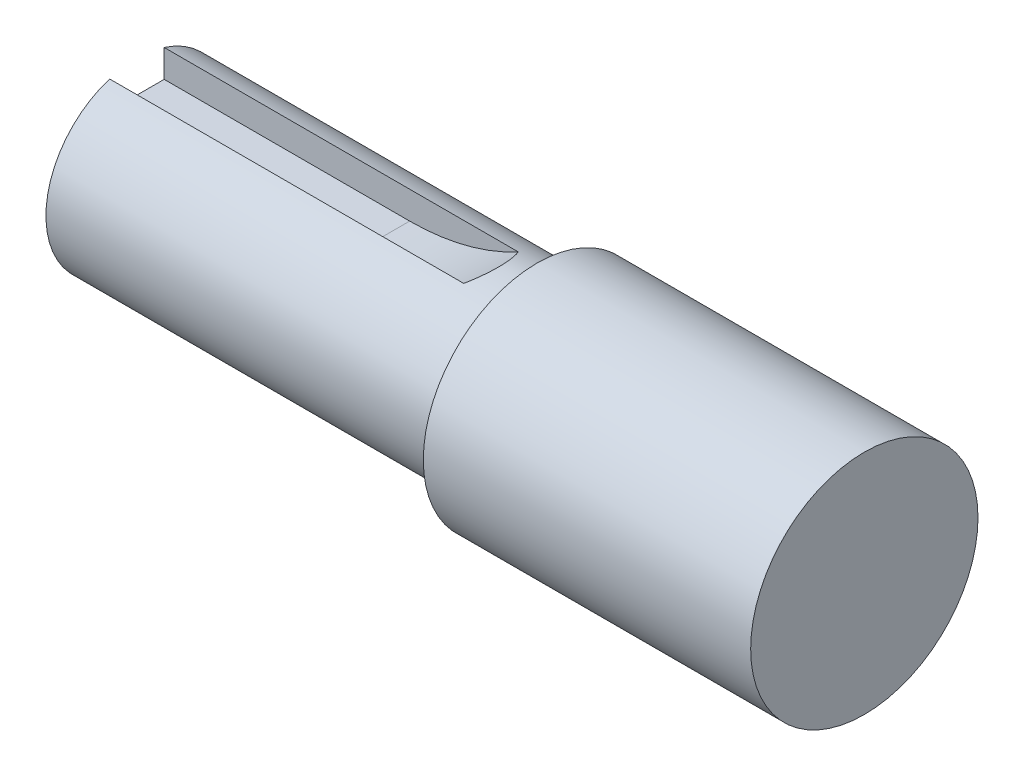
ISO-10303-21;
HEADER;
FILE_DESCRIPTION(('STEP AP214'),'2;1');
FILE_NAME('part.step','',(''),(''),'','','');
FILE_SCHEMA(('AUTOMOTIVE_DESIGN { 1 0 10303 214 1 1 1 1 }'));
ENDSEC;
DATA;
#1=APPLICATION_CONTEXT('core data for automotive mechanical design processes');
#2=APPLICATION_PROTOCOL_DEFINITION('international standard','automotive_design',2000,#1);
#3=PRODUCT_CONTEXT('',#1,'mechanical');
#4=PRODUCT('Part','Part','',(#3));
#5=PRODUCT_RELATED_PRODUCT_CATEGORY('part','',(#4));
#6=PRODUCT_DEFINITION_FORMATION('','',#4);
#7=PRODUCT_DEFINITION_CONTEXT('part definition',#1,'design');
#8=PRODUCT_DEFINITION('design','',#6,#7);
#9=PRODUCT_DEFINITION_SHAPE('','',#8);
#10=(LENGTH_UNIT() NAMED_UNIT(*) SI_UNIT(.MILLI.,.METRE.));
#11=(NAMED_UNIT(*) PLANE_ANGLE_UNIT() SI_UNIT($,.RADIAN.));
#12=(NAMED_UNIT(*) SI_UNIT($,.STERADIAN.) SOLID_ANGLE_UNIT());
#13=UNCERTAINTY_MEASURE_WITH_UNIT(LENGTH_MEASURE(1.E-05),#10,'distance_accuracy_value','');
#14=(GEOMETRIC_REPRESENTATION_CONTEXT(3) GLOBAL_UNCERTAINTY_ASSIGNED_CONTEXT((#13)) GLOBAL_UNIT_ASSIGNED_CONTEXT((#10,
#11,#12)) REPRESENTATION_CONTEXT('',''));
#15=CARTESIAN_POINT('',(0.,0.,0.));
#16=DIRECTION('',(0.,0.,1.));
#17=DIRECTION('',(1.,0.,0.));
#18=AXIS2_PLACEMENT_3D('',#15,#16,#17);
#19=CARTESIAN_POINT('',(-70.,0.,0.));
#20=DIRECTION('',(-1.,0.,0.));
#21=DIRECTION('',(0.,-1.,0.));
#22=AXIS2_PLACEMENT_3D('',#19,#20,#21);
#23=CYLINDRICAL_SURFACE('',#22,10.);
#24=CARTESIAN_POINT('',(0.,0.,0.));
#25=DIRECTION('',(-1.,0.,0.));
#26=DIRECTION('',(0.,-1.,0.));
#27=AXIS2_PLACEMENT_3D('',#24,#25,#26);
#28=CIRCLE('',#27,10.);
#29=CARTESIAN_POINT('',(0.,-10.,0.));
#30=VERTEX_POINT('',#29);
#31=EDGE_CURVE('E139',#30,#30,#28,.T.);
#32=ORIENTED_EDGE('',*,*,#31,.T.);
#33=EDGE_LOOP('',(#32));
#34=FACE_BOUND('',#33,.T.);
#35=DIRECTION('',(-1.,0.,0.));
#36=VECTOR('',#35,1.);
#37=CARTESIAN_POINT('',(-70.,9.53939201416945,-3.));
#38=LINE('',#37,#36);
#39=CARTESIAN_POINT('',(-44.,9.53939201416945,-3.));
#40=VERTEX_POINT('',#39);
#41=CARTESIAN_POINT('',(-5.05296284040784,9.53939201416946,-3.));
#42=VERTEX_POINT('',#41);
#43=EDGE_CURVE('E11',#40,#42,#38,.F.);
#44=ORIENTED_EDGE('',*,*,#43,.T.);
#45=CARTESIAN_POINT('',(-4.24264917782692,10.,0.));
#46=CARTESIAN_POINT('',(-4.24265097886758,9.9999984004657,-0.172945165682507));
#47=CARTESIAN_POINT('',(-4.25022420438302,9.99549969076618,-0.345917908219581));
#48=CARTESIAN_POINT('',(-4.28038157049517,9.97764871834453,-0.690104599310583));
#49=CARTESIAN_POINT('',(-4.30296896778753,9.96429453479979,-0.861318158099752));
#50=CARTESIAN_POINT('',(-4.36276583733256,9.92915135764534,-1.2004312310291));
#51=CARTESIAN_POINT('',(-4.39998753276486,9.90735531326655,-1.36832785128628));
#52=CARTESIAN_POINT('',(-4.4883962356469,9.85600825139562,-1.69915655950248));
#53=CARTESIAN_POINT('',(-4.53958280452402,9.82645747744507,-1.8620888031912));
#54=CARTESIAN_POINT('',(-4.6546356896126,9.7607194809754,-2.18049706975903));
#55=CARTESIAN_POINT('',(-4.71839799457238,9.7245868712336,-2.33602206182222));
#56=CARTESIAN_POINT('',(-4.85792026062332,9.64648041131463,-2.64009614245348));
#57=CARTESIAN_POINT('',(-4.93368640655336,9.60450355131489,-2.78864158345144));
#58=CARTESIAN_POINT('',(-5.1775210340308,9.4713123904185,-3.22267559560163));
#59=CARTESIAN_POINT('',(-5.3622172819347,9.37278382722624,-3.49680959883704));
#60=CARTESIAN_POINT('',(-5.69849488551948,9.19980427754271,-3.92394956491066));
#61=CARTESIAN_POINT('',(-5.84003107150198,9.1285351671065,-4.08648206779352));
#62=CARTESIAN_POINT('',(-6.13674237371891,8.98296416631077,-4.3972430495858));
#63=CARTESIAN_POINT('',(-6.29192146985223,8.90866139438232,-4.54546732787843));
#64=CARTESIAN_POINT('',(-6.61412096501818,8.75873494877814,-4.82806490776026));
#65=CARTESIAN_POINT('',(-6.78115581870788,8.68310975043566,-4.9624207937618));
#66=CARTESIAN_POINT('',(-7.12525749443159,8.53209174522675,-5.21779715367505));
#67=CARTESIAN_POINT('',(-7.30232740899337,8.45669901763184,-5.33881348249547));
#68=CARTESIAN_POINT('',(-7.75133871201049,8.27187312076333,-5.6229001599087));
#69=CARTESIAN_POINT('',(-8.02833018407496,8.16331322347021,-5.7785798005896));
#70=CARTESIAN_POINT('',(-8.59706076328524,7.95254275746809,-6.06537165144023));
#71=CARTESIAN_POINT('',(-8.88880666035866,7.85033516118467,-6.19647241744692));
#72=CARTESIAN_POINT('',(-9.48438702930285,7.65437112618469,-6.43697853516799));
#73=CARTESIAN_POINT('',(-9.78824043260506,7.56062873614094,-6.54634817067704));
#74=CARTESIAN_POINT('',(-10.4051286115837,7.38339409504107,-6.74561111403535));
#75=CARTESIAN_POINT('',(-10.7181631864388,7.29990161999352,-6.8355048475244));
#76=CARTESIAN_POINT('',(-11.263836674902,7.16582422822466,-6.97549675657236));
#77=CARTESIAN_POINT('',(-11.4947688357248,7.1125241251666,-7.02972540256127));
#78=CARTESIAN_POINT('',(-11.9597943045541,7.01218803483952,-7.12981224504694));
#79=CARTESIAN_POINT('',(-12.1938878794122,6.96515258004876,-7.17566973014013));
#80=CARTESIAN_POINT('',(-12.9001939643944,6.83381330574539,-7.30163688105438));
#81=CARTESIAN_POINT('',(-13.3763712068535,6.7592915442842,-7.37012610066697));
#82=CARTESIAN_POINT('',(-14.3357377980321,6.63765988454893,-7.47984670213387));
#83=CARTESIAN_POINT('',(-14.8189343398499,6.59058048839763,-7.52104776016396));
#84=CARTESIAN_POINT('',(-15.788650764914,6.52463705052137,-7.57832537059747));
#85=CARTESIAN_POINT('',(-16.2751701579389,6.50576893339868,-7.59440555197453));
#86=CARTESIAN_POINT('',(-17.2595970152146,6.49639434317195,-7.60242802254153));
#87=CARTESIAN_POINT('',(-17.7575152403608,6.50653324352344,-7.59382103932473));
#88=CARTESIAN_POINT('',(-18.7508324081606,6.55642447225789,-7.55078644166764));
#89=CARTESIAN_POINT('',(-19.246230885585,6.59618208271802,-7.51635422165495));
#90=CARTESIAN_POINT('',(-20.2305708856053,6.70467664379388,-7.41974824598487));
#91=CARTESIAN_POINT('',(-20.7195200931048,6.77337513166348,-7.35761130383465));
#92=CARTESIAN_POINT('',(-21.4454431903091,6.89718723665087,-7.24098917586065));
#93=CARTESIAN_POINT('',(-21.6861481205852,6.94191417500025,-7.19821678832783));
#94=CARTESIAN_POINT('',(-22.1645516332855,7.03805201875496,-7.10424961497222));
#95=CARTESIAN_POINT('',(-22.402250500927,7.08946228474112,-7.05305563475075));
#96=CARTESIAN_POINT('',(-22.9459108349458,7.21531560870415,-6.92456603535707));
#97=CARTESIAN_POINT('',(-23.250608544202,7.29200427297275,-6.84406986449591));
#98=CARTESIAN_POINT('',(-23.8521195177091,7.45534277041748,-6.66576933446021));
#99=CARTESIAN_POINT('',(-24.1489346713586,7.54199018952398,-6.56796916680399));
#100=CARTESIAN_POINT('',(-24.732419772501,7.72389946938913,-6.35304522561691));
#101=CARTESIAN_POINT('',(-25.0191004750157,7.81915179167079,-6.23594273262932));
#102=CARTESIAN_POINT('',(-25.5801017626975,8.01659813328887,-5.97999048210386));
#103=CARTESIAN_POINT('',(-25.8544263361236,8.11878988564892,-5.84114780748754));
#104=CARTESIAN_POINT('',(-26.3119830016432,8.29807910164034,-5.58203717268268));
#105=CARTESIAN_POINT('',(-26.4989906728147,8.37407687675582,-5.4676633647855));
#106=CARTESIAN_POINT('',(-26.8636352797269,8.52723858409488,-5.22558383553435));
#107=CARTESIAN_POINT('',(-27.0412747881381,8.60440218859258,-5.09788180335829));
#108=CARTESIAN_POINT('',(-27.3854285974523,8.75844420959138,-4.82842491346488));
#109=CARTESIAN_POINT('',(-27.5519545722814,8.83532284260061,-4.68668520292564));
#110=CARTESIAN_POINT('',(-27.8721196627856,8.98714908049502,-4.3885279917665));
#111=CARTESIAN_POINT('',(-28.0257622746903,9.06209720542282,-4.23211449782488));
#112=CARTESIAN_POINT('',(-28.3945665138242,9.24633831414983,-3.81834057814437));
#113=CARTESIAN_POINT('',(-28.6000212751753,9.35315728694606,-3.55087743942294));
#114=CARTESIAN_POINT('',(-28.875773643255,9.50052232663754,-3.12454170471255));
#115=CARTESIAN_POINT('',(-28.9623137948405,9.54751605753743,-2.97817708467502));
#116=CARTESIAN_POINT('',(-29.1235408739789,9.63614446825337,-2.67754292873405));
#117=CARTESIAN_POINT('',(-29.1982338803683,9.67778189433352,-2.52327750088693));
#118=CARTESIAN_POINT('',(-29.3353994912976,9.75501903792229,-2.20601954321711));
#119=CARTESIAN_POINT('',(-29.397743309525,9.79055465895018,-2.04295553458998));
#120=CARTESIAN_POINT('',(-29.5082752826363,9.85405077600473,-1.71063971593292));
#121=CARTESIAN_POINT('',(-29.5564631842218,9.88201113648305,-1.54138779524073));
#122=CARTESIAN_POINT('',(-29.6377949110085,9.92945613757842,-1.19827723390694));
#123=CARTESIAN_POINT('',(-29.6709507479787,9.94894754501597,-1.02442238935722));
#124=CARTESIAN_POINT('',(-29.7216442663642,9.97883265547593,-0.673687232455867));
#125=CARTESIAN_POINT('',(-29.7391846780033,9.98922794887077,-0.496807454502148));
#126=CARTESIAN_POINT('',(-29.7568848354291,9.99972175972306,-0.168464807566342));
#127=CARTESIAN_POINT('',(-29.7592519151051,10.0011278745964,-0.017157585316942));
#128=CARTESIAN_POINT('',(-29.7524244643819,9.99707718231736,0.285102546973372));
#129=CARTESIAN_POINT('',(-29.7432305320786,9.99162073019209,0.436055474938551));
#130=CARTESIAN_POINT('',(-29.7134154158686,9.97398399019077,0.736389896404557));
#131=CARTESIAN_POINT('',(-29.6927968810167,9.9618052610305,0.885771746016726));
#132=CARTESIAN_POINT('',(-29.6404234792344,9.9310265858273,1.18189387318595));
#133=CARTESIAN_POINT('',(-29.6086683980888,9.91242651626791,1.32863409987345));
#134=CARTESIAN_POINT('',(-29.5359724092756,9.87013438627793,1.61250862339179));
#135=CARTESIAN_POINT('',(-29.495463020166,9.84668321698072,1.74978977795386));
#136=CARTESIAN_POINT('',(-29.4050655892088,9.79476889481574,2.02027109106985));
#137=CARTESIAN_POINT('',(-29.3551747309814,9.76630423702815,2.15347001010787));
#138=CARTESIAN_POINT('',(-29.1922384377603,9.67421419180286,2.54590683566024));
#139=CARTESIAN_POINT('',(-29.0658856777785,9.60386681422,2.79815199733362));
#140=CARTESIAN_POINT('',(-28.7293566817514,9.42125508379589,3.37062534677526));
#141=CARTESIAN_POINT('',(-28.5055125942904,9.30316207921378,3.68090188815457));
#142=CARTESIAN_POINT('',(-28.0119402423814,9.05420899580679,4.25678851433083));
#143=CARTESIAN_POINT('',(-27.7421252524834,8.9233249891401,4.52231225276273));
#144=CARTESIAN_POINT('',(-27.2515656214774,8.69745956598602,4.93890068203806));
#145=CARTESIAN_POINT('',(-27.0394635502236,8.60314144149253,5.10076065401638));
#146=CARTESIAN_POINT('',(-26.6007046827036,8.41573426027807,5.40437475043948));
#147=CARTESIAN_POINT('',(-26.3740419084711,8.32264572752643,5.54612053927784));
#148=CARTESIAN_POINT('',(-25.9085490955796,8.1397687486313,5.81120791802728));
#149=CARTESIAN_POINT('',(-25.6697025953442,8.04998506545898,5.93452367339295));
#150=CARTESIAN_POINT('',(-25.1821995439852,7.87546348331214,6.16424025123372));
#151=CARTESIAN_POINT('',(-24.9335399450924,7.79072717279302,6.27063576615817));
#152=CARTESIAN_POINT('',(-24.3006953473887,7.58642277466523,6.51793480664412));
#153=CARTESIAN_POINT('',(-23.9114232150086,7.47084763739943,6.64917000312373));
#154=CARTESIAN_POINT('',(-23.1194178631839,7.25703638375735,6.88188436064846));
#155=CARTESIAN_POINT('',(-22.7166780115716,7.15880896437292,6.98334861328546));
#156=CARTESIAN_POINT('',(-21.9010795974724,6.98156328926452,7.16055016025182));
#157=CARTESIAN_POINT('',(-21.4882120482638,6.90256282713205,7.23626364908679));
#158=CARTESIAN_POINT('',(-20.6556784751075,6.76512476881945,7.36491150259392));
#159=CARTESIAN_POINT('',(-20.2360134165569,6.70668427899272,7.4178490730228));
#160=CARTESIAN_POINT('',(-19.3748166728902,6.60912415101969,7.50492725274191));
#161=CARTESIAN_POINT('',(-18.9330966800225,6.57090018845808,7.53820313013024));
#162=CARTESIAN_POINT('',(-18.0471645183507,6.51799840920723,7.58399027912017));
#163=CARTESIAN_POINT('',(-17.6029521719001,6.50332229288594,7.59650005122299));
#164=CARTESIAN_POINT('',(-16.7142138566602,6.49768366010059,7.60132361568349));
#165=CARTESIAN_POINT('',(-16.2696878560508,6.50672405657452,7.59363492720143));
#166=CARTESIAN_POINT('',(-15.382593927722,6.54842416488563,7.5577051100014));
#167=CARTESIAN_POINT('',(-14.9400258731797,6.58108232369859,7.5294653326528));
#168=CARTESIAN_POINT('',(-14.0691859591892,6.66861983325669,7.45203641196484));
#169=CARTESIAN_POINT('',(-13.6408181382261,6.72297585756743,7.40333931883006));
#170=CARTESIAN_POINT('',(-12.7905066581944,6.85319228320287,7.28296922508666));
#171=CARTESIAN_POINT('',(-12.3685640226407,6.92905607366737,7.21129260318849));
#172=CARTESIAN_POINT('',(-11.5346568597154,7.10100363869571,7.04203769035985));
#173=CARTESIAN_POINT('',(-11.1226797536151,7.19706026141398,6.94449413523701));
#174=CARTESIAN_POINT('',(-10.3118678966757,7.40759484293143,6.71947487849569));
#175=CARTESIAN_POINT('',(-9.91302620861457,7.52206288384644,6.59201527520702));
#176=CARTESIAN_POINT('',(-9.28044908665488,7.72031560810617,6.35692857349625));
#177=CARTESIAN_POINT('',(-9.04122951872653,7.79936837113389,6.25998188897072));
#178=CARTESIAN_POINT('',(-8.57115658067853,7.96244674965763,6.05119937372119));
#179=CARTESIAN_POINT('',(-8.34030097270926,8.04647101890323,5.93936756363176));
#180=CARTESIAN_POINT('',(-7.88883884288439,8.21814058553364,5.6994643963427));
#181=CARTESIAN_POINT('',(-7.66822266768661,8.30578231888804,5.57140877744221));
#182=CARTESIAN_POINT('',(-7.23918415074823,8.48304061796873,5.29760333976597));
#183=CARTESIAN_POINT('',(-7.03075855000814,8.57265664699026,5.15185828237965));
#184=CARTESIAN_POINT('',(-6.52515869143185,8.79783648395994,4.76149167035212));
#185=CARTESIAN_POINT('',(-6.23728575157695,8.93339534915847,4.50449323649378));
#186=CARTESIAN_POINT('',(-5.70582757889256,9.19463399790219,3.9438529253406));
#187=CARTESIAN_POINT('',(-5.46218496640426,9.32032645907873,3.64027243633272));
#188=CARTESIAN_POINT('',(-5.07561574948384,9.52621924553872,3.05396706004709));
#189=CARTESIAN_POINT('',(-4.92228240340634,9.61046866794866,2.77962998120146));
#190=CARTESIAN_POINT('',(-4.72447250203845,9.72117700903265,2.34961992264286));
#191=CARTESIAN_POINT('',(-4.66390467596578,9.75546657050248,2.20321241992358));
#192=CARTESIAN_POINT('',(-4.55419928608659,9.81807111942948,1.90490421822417));
#193=CARTESIAN_POINT('',(-4.50506027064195,9.84638686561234,1.75300421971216));
#194=CARTESIAN_POINT('',(-4.42597459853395,9.89223249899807,1.46996825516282));
#195=CARTESIAN_POINT('',(-4.39420324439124,9.91076909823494,1.33950118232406));
#196=CARTESIAN_POINT('',(-4.33948191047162,9.94281350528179,1.07612664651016));
#197=CARTESIAN_POINT('',(-4.31653088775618,9.95632190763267,0.943219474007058));
#198=CARTESIAN_POINT('',(-4.27969551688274,9.97805041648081,0.675669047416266));
#199=CARTESIAN_POINT('',(-4.26581470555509,9.98626846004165,0.541025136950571));
#200=CARTESIAN_POINT('',(-4.24729212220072,9.99724311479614,0.270926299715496));
#201=CARTESIAN_POINT('',(-4.24264776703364,10.0000012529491,0.135471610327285));
#202=CARTESIAN_POINT('',(-4.24264917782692,10.,0.));
#203=B_SPLINE_CURVE_WITH_KNOTS('',3,(#45,#46,#47,#48,#49,#50,#51,#52,#53,#54,#55,#56,#57,#58,
#59,#60,#61,#62,#63,#64,#65,#66,#67,#68,#69,#70,#71,#72,#73,#74,#75,#76,#77,#78,#79,#80,#81,#82,
#83,#84,#85,#86,#87,#88,#89,#90,#91,#92,#93,#94,#95,#96,#97,#98,#99,#100,#101,#102,#103,#104,
#105,#106,#107,#108,#109,#110,#111,#112,#113,#114,#115,#116,#117,#118,#119,#120,#121,#122,#123,
#124,#125,#126,#127,#128,#129,#130,#131,#132,#133,#134,#135,#136,#137,#138,#139,#140,#141,#142,
#143,#144,#145,#146,#147,#148,#149,#150,#151,#152,#153,#154,#155,#156,#157,#158,#159,#160,#161,
#162,#163,#164,#165,#166,#167,#168,#169,#170,#171,#172,#173,#174,#175,#176,#177,#178,#179,#180,
#181,#182,#183,#184,#185,#186,#187,#188,#189,#190,#191,#192,#193,#194,#195,#196,#197,#198,#199,
#200,#201,#202),.UNSPECIFIED.,.T.,.F.,(4,2,2,2,2,2,2,2,2,2,2,2,2,2,2,2,2,2,2,2,2,2,2,2,2,2,2,2,
2,2,2,2,2,2,2,2,2,2,2,2,2,2,2,2,2,2,2,2,2,2,2,2,2,2,2,2,2,2,2,2,2,2,2,2,2,2,2,2,2,2,2,2,2,2,2,2,
2,2,4),(0.,0.518661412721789,1.03743536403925,1.55664354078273,2.07583541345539,
2.59090078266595,3.10623240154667,4.13609729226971,4.81632818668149,5.49675818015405,
6.17803250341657,6.85951793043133,7.86528815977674,8.87152552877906,9.87940326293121,
10.8872589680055,11.616399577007,12.3456021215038,13.8041993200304,15.264414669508,
16.7244190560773,18.217157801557,19.7101628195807,21.2011898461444,21.9465818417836,
22.6919025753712,23.6642730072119,24.6364082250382,25.6074787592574,26.5782335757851,
27.2737634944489,27.9691014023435,28.6636970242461,29.3581035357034,30.4146714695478,
30.9433716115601,31.4717995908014,32.0054776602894,32.539165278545,33.0724256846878,
33.6055928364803,34.059009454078,34.5124026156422,34.9656906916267,35.4189874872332,
35.8536407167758,36.2884246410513,37.1574740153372,38.3522254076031,39.5492562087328,
40.3971337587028,41.2453616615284,42.0947676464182,42.9444395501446,44.22274535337,
45.5016902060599,46.7818141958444,48.0617579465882,49.3944596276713,50.7272575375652,
52.0602191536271,53.3930931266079,54.695594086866,55.9983004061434,57.2992661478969,
58.5995334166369,59.4088920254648,60.21803245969,61.0263938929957,61.8345382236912,
63.0571198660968,64.278103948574,65.2499060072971,65.7357242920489,66.2214808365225,
66.6277627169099,67.0339965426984,67.4403886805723,67.8466671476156),.UNSPECIFIED.);
#204=CARTESIAN_POINT('',(-5.05296284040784,9.53939201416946,3.));
#205=VERTEX_POINT('',#204);
#206=EDGE_CURVE('E95',#205,#42,#203,.T.);
#207=ORIENTED_EDGE('',*,*,#206,.F.);
#208=DIRECTION('',(-1.,0.,0.));
#209=VECTOR('',#208,1.);
#210=CARTESIAN_POINT('',(-70.,9.53939201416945,3.));
#211=LINE('',#210,#209);
#212=CARTESIAN_POINT('',(-44.,9.53939201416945,3.));
#213=VERTEX_POINT('',#212);
#214=EDGE_CURVE('E38',#205,#213,#211,.T.);
#215=ORIENTED_EDGE('',*,*,#214,.T.);
#216=CARTESIAN_POINT('',(-44.,0.,0.));
#217=DIRECTION('',(-1.,0.,0.));
#218=DIRECTION('',(0.,-1.,0.));
#219=AXIS2_PLACEMENT_3D('',#216,#217,#218);
#220=CIRCLE('',#219,10.);
#221=EDGE_CURVE('E141',#40,#213,#220,.T.);
#222=ORIENTED_EDGE('',*,*,#221,.F.);
#223=EDGE_LOOP('',(#44,#207,#215,#222));
#224=FACE_BOUND('',#223,.T.);
#225=ADVANCED_FACE('F30',(#34,#224),#23,.T.);
#226=CARTESIAN_POINT('',(0.,10.,0.));
#227=DIRECTION('',(1.,0.,0.));
#228=DIRECTION('',(0.,1.,0.));
#229=AXIS2_PLACEMENT_3D('',#226,#227,#228);
#230=PLANE('',#229);
#231=ORIENTED_EDGE('',*,*,#31,.F.);
#232=EDGE_LOOP('',(#231));
#233=FACE_BOUND('',#232,.T.);
#234=CARTESIAN_POINT('',(0.,0.,0.));
#235=DIRECTION('',(-1.,0.,0.));
#236=DIRECTION('',(0.,-1.,0.));
#237=AXIS2_PLACEMENT_3D('',#234,#235,#236);
#238=CIRCLE('',#237,12.5);
#239=CARTESIAN_POINT('',(0.,-12.5,0.));
#240=VERTEX_POINT('',#239);
#241=EDGE_CURVE('E164',#240,#240,#238,.T.);
#242=ORIENTED_EDGE('',*,*,#241,.T.);
#243=EDGE_LOOP('',(#242));
#244=FACE_BOUND('',#243,.T.);
#245=ADVANCED_FACE('F32',(#233,#244),#230,.F.);
#246=CARTESIAN_POINT('',(-70.,0.,0.));
#247=DIRECTION('',(-1.,0.,0.));
#248=DIRECTION('',(0.,-1.,0.));
#249=AXIS2_PLACEMENT_3D('',#246,#247,#248);
#250=CYLINDRICAL_SURFACE('',#249,12.5);
#251=ORIENTED_EDGE('',*,*,#241,.F.);
#252=EDGE_LOOP('',(#251));
#253=FACE_BOUND('',#252,.T.);
#254=CARTESIAN_POINT('',(36.,0.,0.));
#255=DIRECTION('',(-1.,0.,0.));
#256=DIRECTION('',(0.,-1.,0.));
#257=AXIS2_PLACEMENT_3D('',#254,#255,#256);
#258=CIRCLE('',#257,12.5);
#259=CARTESIAN_POINT('',(36.,-12.5,0.));
#260=VERTEX_POINT('',#259);
#261=EDGE_CURVE('E161',#260,#260,#258,.T.);
#262=ORIENTED_EDGE('',*,*,#261,.T.);
#263=EDGE_LOOP('',(#262));
#264=FACE_BOUND('',#263,.T.);
#265=ADVANCED_FACE('F135',(#253,#264),#250,.T.);
#266=CARTESIAN_POINT('',(36.,12.5,0.));
#267=DIRECTION('',(-1.,0.,0.));
#268=DIRECTION('',(0.,-1.,0.));
#269=AXIS2_PLACEMENT_3D('',#266,#267,#268);
#270=PLANE('',#269);
#271=ORIENTED_EDGE('',*,*,#261,.F.);
#272=EDGE_LOOP('',(#271));
#273=FACE_BOUND('',#272,.T.);
#274=ADVANCED_FACE('F128',(#273),#270,.F.);
#275=CARTESIAN_POINT('',(-44.,0.,0.));
#276=DIRECTION('',(1.,0.,0.));
#277=DIRECTION('',(0.,1.,0.));
#278=AXIS2_PLACEMENT_3D('',#275,#276,#277);
#279=PLANE('',#278);
#280=CARTESIAN_POINT('',(-44.,0.,0.));
#281=DIRECTION('',(-1.,0.,0.));
#282=DIRECTION('',(0.,0.,1.));
#283=AXIS2_PLACEMENT_3D('',#280,#281,#282);
#284=CIRCLE('',#283,4.);
#285=CARTESIAN_POINT('',(-44.,0.,4.));
#286=VERTEX_POINT('',#285);
#287=EDGE_CURVE('E87',#286,#286,#284,.T.);
#288=ORIENTED_EDGE('',*,*,#287,.F.);
#289=EDGE_LOOP('',(#288));
#290=FACE_BOUND('',#289,.T.);
#291=DIRECTION('',(0.,0.,1.));
#292=VECTOR('',#291,1.);
#293=CARTESIAN_POINT('',(-44.,6.49999999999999,-3.));
#294=LINE('',#293,#292);
#295=CARTESIAN_POINT('',(-44.,6.49999999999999,-3.));
#296=VERTEX_POINT('',#295);
#297=CARTESIAN_POINT('',(-44.,6.49999999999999,3.));
#298=VERTEX_POINT('',#297);
#299=EDGE_CURVE('E155',#296,#298,#294,.T.);
#300=ORIENTED_EDGE('',*,*,#299,.F.);
#301=DIRECTION('',(0.,-1.,0.));
#302=VECTOR('',#301,1.);
#303=CARTESIAN_POINT('',(-44.,6.49999999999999,-3.));
#304=LINE('',#303,#302);
#305=EDGE_CURVE('E102',#40,#296,#304,.T.);
#306=ORIENTED_EDGE('',*,*,#305,.F.);
#307=ORIENTED_EDGE('',*,*,#221,.T.);
#308=DIRECTION('',(0.,1.,0.));
#309=VECTOR('',#308,1.);
#310=CARTESIAN_POINT('',(-44.,6.49999999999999,3.));
#311=LINE('',#310,#309);
#312=EDGE_CURVE('E153',#298,#213,#311,.T.);
#313=ORIENTED_EDGE('',*,*,#312,.F.);
#314=EDGE_LOOP('',(#300,#306,#307,#313));
#315=FACE_BOUND('',#314,.T.);
#316=ADVANCED_FACE('F124',(#290,#315),#279,.F.);
#317=CARTESIAN_POINT('',(-17.,6.5,-3.));
#318=DIRECTION('',(0.,0.,-1.));
#319=DIRECTION('',(-1.,0.,0.));
#320=AXIS2_PLACEMENT_3D('',#317,#318,#319);
#321=PLANE('',#320);
#322=CARTESIAN_POINT('',(-17.,31.5,-3.));
#323=DIRECTION('',(0.,0.,1.));
#324=DIRECTION('',(1.,0.,0.));
#325=AXIS2_PLACEMENT_3D('',#322,#323,#324);
#326=CIRCLE('',#325,25.);
#327=CARTESIAN_POINT('',(-17.,6.5,-3.));
#328=VERTEX_POINT('',#327);
#329=EDGE_CURVE('E90',#328,#42,#326,.T.);
#330=ORIENTED_EDGE('',*,*,#329,.T.);
#331=ORIENTED_EDGE('',*,*,#43,.F.);
#332=ORIENTED_EDGE('',*,*,#305,.T.);
#333=DIRECTION('',(-1.,0.,0.));
#334=VECTOR('',#333,1.);
#335=CARTESIAN_POINT('',(-17.,6.5,-3.));
#336=LINE('',#335,#334);
#337=EDGE_CURVE('E145',#328,#296,#336,.T.);
#338=ORIENTED_EDGE('',*,*,#337,.F.);
#339=EDGE_LOOP('',(#330,#331,#332,#338));
#340=FACE_BOUND('',#339,.T.);
#341=ADVANCED_FACE('F119',(#340),#321,.F.);
#342=CARTESIAN_POINT('',(-17.,6.5,3.));
#343=DIRECTION('',(0.,0.,1.));
#344=DIRECTION('',(1.,0.,0.));
#345=AXIS2_PLACEMENT_3D('',#342,#343,#344);
#346=PLANE('',#345);
#347=ORIENTED_EDGE('',*,*,#214,.F.);
#348=CARTESIAN_POINT('',(-17.,31.5,3.));
#349=DIRECTION('',(0.,0.,1.));
#350=DIRECTION('',(1.,0.,0.));
#351=AXIS2_PLACEMENT_3D('',#348,#349,#350);
#352=CIRCLE('',#351,25.);
#353=CARTESIAN_POINT('',(-17.,6.5,3.));
#354=VERTEX_POINT('',#353);
#355=EDGE_CURVE('E92',#354,#205,#352,.T.);
#356=ORIENTED_EDGE('',*,*,#355,.F.);
#357=DIRECTION('',(-1.,0.,0.));
#358=VECTOR('',#357,1.);
#359=CARTESIAN_POINT('',(-17.,6.5,3.));
#360=LINE('',#359,#358);
#361=EDGE_CURVE('E149',#354,#298,#360,.T.);
#362=ORIENTED_EDGE('',*,*,#361,.T.);
#363=ORIENTED_EDGE('',*,*,#312,.T.);
#364=EDGE_LOOP('',(#347,#356,#362,#363));
#365=FACE_BOUND('',#364,.T.);
#366=ADVANCED_FACE('F116',(#365),#346,.F.);
#367=CARTESIAN_POINT('',(-17.,6.5,-3.));
#368=DIRECTION('',(0.,-1.,0.));
#369=DIRECTION('',(1.,0.,0.));
#370=AXIS2_PLACEMENT_3D('',#367,#368,#369);
#371=PLANE('',#370);
#372=ORIENTED_EDGE('',*,*,#299,.T.);
#373=ORIENTED_EDGE('',*,*,#361,.F.);
#374=DIRECTION('',(0.,0.,1.));
#375=VECTOR('',#374,1.);
#376=CARTESIAN_POINT('',(-17.,6.5,-3.));
#377=LINE('',#376,#375);
#378=EDGE_CURVE('E150',#328,#354,#377,.T.);
#379=ORIENTED_EDGE('',*,*,#378,.F.);
#380=ORIENTED_EDGE('',*,*,#337,.T.);
#381=EDGE_LOOP('',(#372,#373,#379,#380));
#382=FACE_BOUND('',#381,.T.);
#383=ADVANCED_FACE('F113',(#382),#371,.F.);
#384=CARTESIAN_POINT('',(-17.,31.5,73.7106781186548));
#385=DIRECTION('',(0.,0.,-1.));
#386=DIRECTION('',(-1.,0.,0.));
#387=AXIS2_PLACEMENT_3D('',#384,#385,#386);
#388=CYLINDRICAL_SURFACE('',#387,25.);
#389=ORIENTED_EDGE('',*,*,#206,.T.);
#390=ORIENTED_EDGE('',*,*,#329,.F.);
#391=ORIENTED_EDGE('',*,*,#378,.T.);
#392=ORIENTED_EDGE('',*,*,#355,.T.);
#393=EDGE_LOOP('',(#389,#390,#391,#392));
#394=FACE_BOUND('',#393,.T.);
#395=ADVANCED_FACE('F107',(#394),#388,.F.);
#396=CARTESIAN_POINT('',(-44.,0.,0.));
#397=DIRECTION('',(-1.,0.,0.));
#398=DIRECTION('',(0.,0.,1.));
#399=AXIS2_PLACEMENT_3D('',#396,#397,#398);
#400=CYLINDRICAL_SURFACE('',#399,4.);
#401=CARTESIAN_POINT('',(-14.,0.,0.));
#402=DIRECTION('',(-1.,0.,0.));
#403=DIRECTION('',(0.,0.,1.));
#404=AXIS2_PLACEMENT_3D('',#401,#402,#403);
#405=CIRCLE('',#404,4.);
#406=CARTESIAN_POINT('',(-14.,0.,4.));
#407=VERTEX_POINT('',#406);
#408=EDGE_CURVE('E82',#407,#407,#405,.T.);
#409=ORIENTED_EDGE('',*,*,#408,.F.);
#410=EDGE_LOOP('',(#409));
#411=FACE_BOUND('',#410,.T.);
#412=ORIENTED_EDGE('',*,*,#287,.T.);
#413=EDGE_LOOP('',(#412));
#414=FACE_BOUND('',#413,.T.);
#415=ADVANCED_FACE('F112',(#411,#414),#400,.F.);
#416=CARTESIAN_POINT('',(-14.,3.39999999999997,0.));
#417=DIRECTION('',(1.,0.,0.));
#418=DIRECTION('',(0.,0.,-1.));
#419=AXIS2_PLACEMENT_3D('',#416,#417,#418);
#420=PLANE('',#419);
#421=CARTESIAN_POINT('',(-14.,0.,0.));
#422=DIRECTION('',(-1.,0.,0.));
#423=DIRECTION('',(0.,0.,1.));
#424=AXIS2_PLACEMENT_3D('',#421,#422,#423);
#425=CIRCLE('',#424,3.39999999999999);
#426=CARTESIAN_POINT('',(-14.,0.,3.39999999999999));
#427=VERTEX_POINT('',#426);
#428=EDGE_CURVE('E79',#427,#427,#425,.T.);
#429=ORIENTED_EDGE('',*,*,#428,.F.);
#430=EDGE_LOOP('',(#429));
#431=FACE_BOUND('',#430,.T.);
#432=ORIENTED_EDGE('',*,*,#408,.T.);
#433=EDGE_LOOP('',(#432));
#434=FACE_BOUND('',#433,.T.);
#435=ADVANCED_FACE('F217',(#431,#434),#420,.F.);
#436=CARTESIAN_POINT('',(-44.,0.,0.));
#437=DIRECTION('',(-1.,0.,0.));
#438=DIRECTION('',(0.,0.,1.));
#439=AXIS2_PLACEMENT_3D('',#436,#437,#438);
#440=CYLINDRICAL_SURFACE('',#439,3.39999999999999);
#441=CARTESIAN_POINT('',(-7.99999999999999,0.,0.));
#442=DIRECTION('',(-1.,0.,0.));
#443=DIRECTION('',(0.,0.,1.));
#444=AXIS2_PLACEMENT_3D('',#441,#442,#443);
#445=CIRCLE('',#444,3.39999999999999);
#446=CARTESIAN_POINT('',(-7.99999999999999,0.,3.39999999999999));
#447=VERTEX_POINT('',#446);
#448=EDGE_CURVE('E77',#447,#447,#445,.T.);
#449=ORIENTED_EDGE('',*,*,#448,.F.);
#450=EDGE_LOOP('',(#449));
#451=FACE_BOUND('',#450,.T.);
#452=ORIENTED_EDGE('',*,*,#428,.T.);
#453=EDGE_LOOP('',(#452));
#454=FACE_BOUND('',#453,.T.);
#455=ADVANCED_FACE('F73',(#451,#454),#440,.F.);
#456=CARTESIAN_POINT('',(-7.99999999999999,0.,0.));
#457=DIRECTION('',(-1.,0.,0.));
#458=DIRECTION('',(0.,0.,1.));
#459=AXIS2_PLACEMENT_3D('',#456,#457,#458);
#460=CONICAL_SURFACE('',#459,3.39999999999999,1.02974425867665);
#461=CARTESIAN_POINT('',(-5.95707389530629,0.,0.));
#462=VERTEX_POINT('',#461);
#463=VERTEX_LOOP('',#462);
#464=FACE_BOUND('',#463,.T.);
#465=ORIENTED_EDGE('',*,*,#448,.T.);
#466=EDGE_LOOP('',(#465));
#467=FACE_BOUND('',#466,.T.);
#468=ADVANCED_FACE('F70',(#464,#467),#460,.F.);
#469=CLOSED_SHELL('',(#225,#245,#265,#274,#316,#341,#366,#383,#395,#415,#435,#455,#468));
#470=MANIFOLD_SOLID_BREP('B2',#469);
#471=ADVANCED_BREP_SHAPE_REPRESENTATION('',(#18,#470),#14);
#472=SHAPE_DEFINITION_REPRESENTATION(#9,#471);
ENDSEC;
END-ISO-10303-21;
